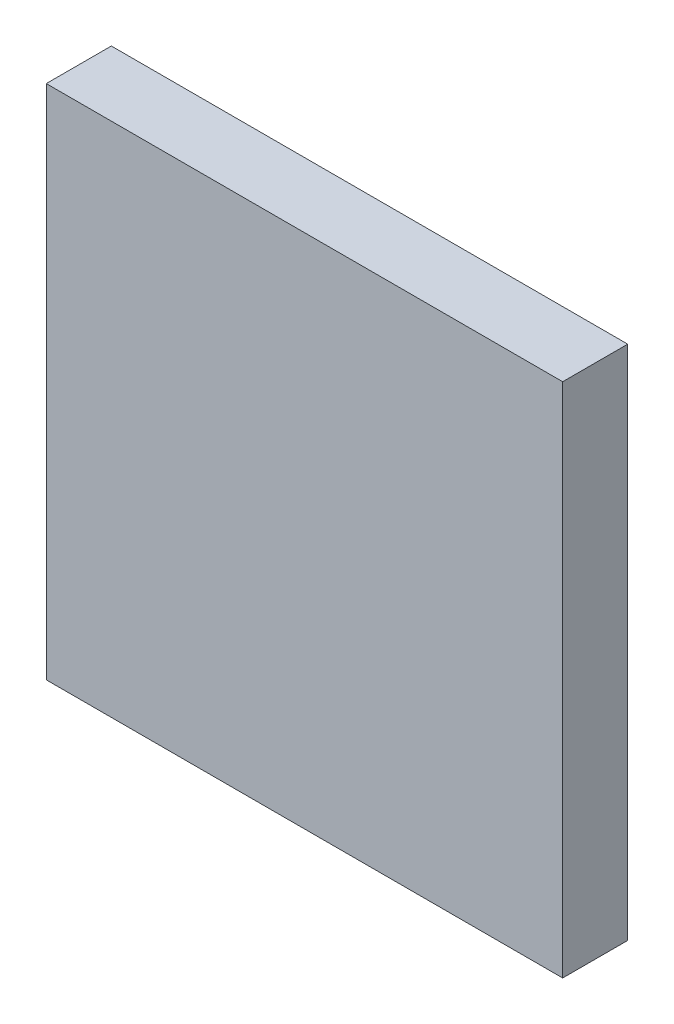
from build123d import *

# Parameters (mm, degrees)
SKETCH1_W      = 25.4
SKETCH1_H      = 25.4
EXTRUDE1_DEPTH = 3.2004


with BuildPart() as part:
    # Sketch1 → Extrude1 (new body)
    with BuildSketch(Plane.XY):
        with Locations((-12.7, 12.7)):
            Rectangle(SKETCH1_W, SKETCH1_H)
    extrude(amount=EXTRUDE1_DEPTH)


solid = part.part
